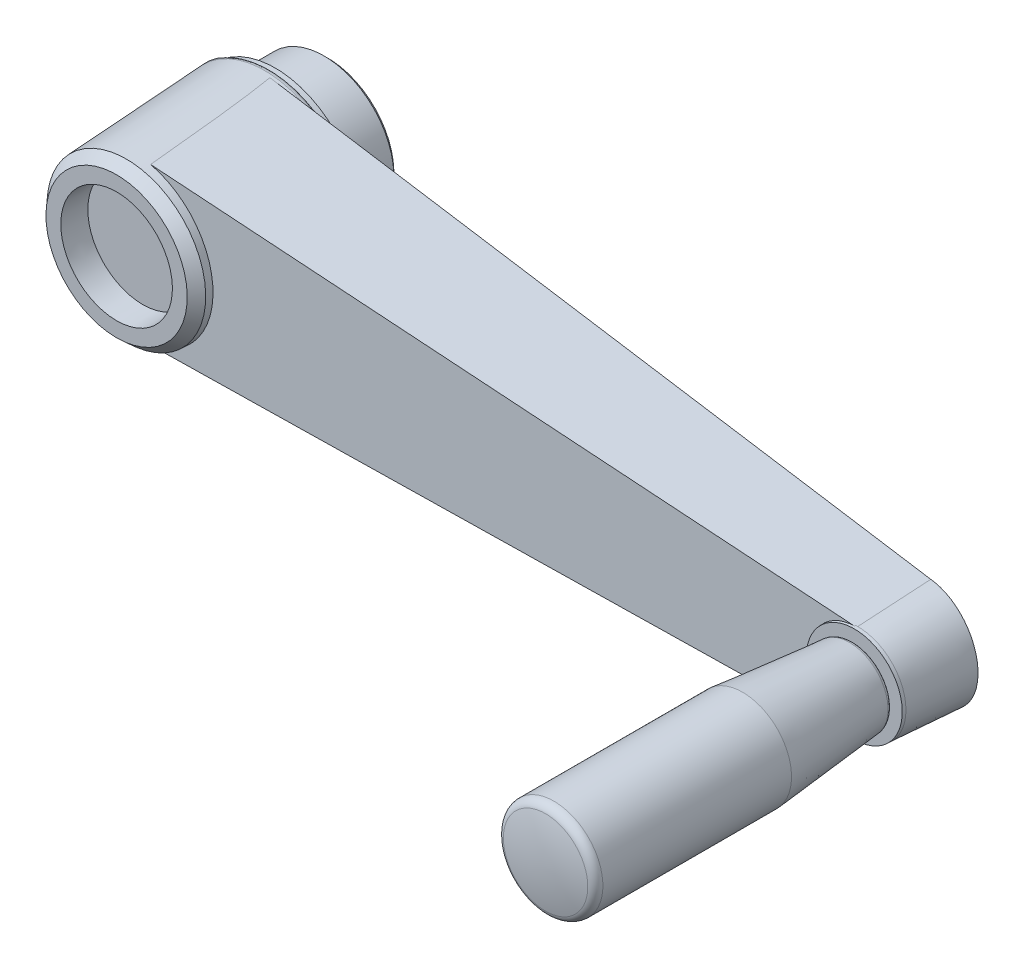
ISO-10303-21;
HEADER;
FILE_DESCRIPTION(('STEP AP214'),'2;1');
FILE_NAME('part.step','',(''),(''),'','','');
FILE_SCHEMA(('AUTOMOTIVE_DESIGN { 1 0 10303 214 1 1 1 1 }'));
ENDSEC;
DATA;
#1=APPLICATION_CONTEXT('core data for automotive mechanical design processes');
#2=APPLICATION_PROTOCOL_DEFINITION('international standard','automotive_design',2000,#1);
#3=PRODUCT_CONTEXT('',#1,'mechanical');
#4=PRODUCT('Part','Part','',(#3));
#5=PRODUCT_RELATED_PRODUCT_CATEGORY('part','',(#4));
#6=PRODUCT_DEFINITION_FORMATION('','',#4);
#7=PRODUCT_DEFINITION_CONTEXT('part definition',#1,'design');
#8=PRODUCT_DEFINITION('design','',#6,#7);
#9=PRODUCT_DEFINITION_SHAPE('','',#8);
#10=(LENGTH_UNIT() NAMED_UNIT(*) SI_UNIT(.MILLI.,.METRE.));
#11=(NAMED_UNIT(*) PLANE_ANGLE_UNIT() SI_UNIT($,.RADIAN.));
#12=(NAMED_UNIT(*) SI_UNIT($,.STERADIAN.) SOLID_ANGLE_UNIT());
#13=UNCERTAINTY_MEASURE_WITH_UNIT(LENGTH_MEASURE(1.E-05),#10,'distance_accuracy_value','');
#14=(GEOMETRIC_REPRESENTATION_CONTEXT(3) GLOBAL_UNCERTAINTY_ASSIGNED_CONTEXT((#13)) GLOBAL_UNIT_ASSIGNED_CONTEXT((#10,
#11,#12)) REPRESENTATION_CONTEXT('',''));
#15=CARTESIAN_POINT('',(0.,0.,0.));
#16=DIRECTION('',(0.,0.,1.));
#17=DIRECTION('',(1.,0.,0.));
#18=AXIS2_PLACEMENT_3D('',#15,#16,#17);
#19=CARTESIAN_POINT('',(-20.25,0.,60.5));
#20=DIRECTION('',(0.,0.,-1.));
#21=DIRECTION('',(0.,1.,0.));
#22=AXIS2_PLACEMENT_3D('',#19,#20,#21);
#23=PLANE('',#22);
#24=CARTESIAN_POINT('',(0.,0.,60.5));
#25=DIRECTION('',(0.,0.,1.));
#26=DIRECTION('',(0.,-1.,0.));
#27=AXIS2_PLACEMENT_3D('',#24,#25,#26);
#28=CIRCLE('',#27,20.25);
#29=CARTESIAN_POINT('',(0.,-20.25,60.5));
#30=VERTEX_POINT('',#29);
#31=EDGE_CURVE('E130',#30,#30,#28,.T.);
#32=ORIENTED_EDGE('',*,*,#31,.T.);
#33=EDGE_LOOP('',(#32));
#34=FACE_BOUND('',#33,.T.);
#35=CARTESIAN_POINT('',(0.,0.,60.5));
#36=DIRECTION('',(0.,0.,1.));
#37=DIRECTION('',(0.,-1.,0.));
#38=AXIS2_PLACEMENT_3D('',#35,#36,#37);
#39=CIRCLE('',#38,16.);
#40=CARTESIAN_POINT('',(0.,-16.,60.5));
#41=VERTEX_POINT('',#40);
#42=EDGE_CURVE('E98',#41,#41,#39,.T.);
#43=ORIENTED_EDGE('',*,*,#42,.F.);
#44=EDGE_LOOP('',(#43));
#45=FACE_BOUND('',#44,.T.);
#46=ADVANCED_FACE('F14',(#34,#45),#23,.F.);
#47=CARTESIAN_POINT('',(-25.,-25.,16.30400452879));
#48=DIRECTION('',(-0.095556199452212,0.,0.995424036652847));
#49=DIRECTION('',(-0.995424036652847,0.,-0.095556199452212));
#50=AXIS2_PLACEMENT_3D('',#47,#48,#49);
#51=PLANE('',#50);
#52=DIRECTION('',(0.994371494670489,0.0459743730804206,0.0954551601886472));
#53=VECTOR('',#52,1.);
#54=CARTESIAN_POINT('',(-24.953874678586,-26.0068296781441,16.308432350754));
#55=LINE('',#54,#53);
#56=CARTESIAN_POINT('',(211.9725550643,-15.0526298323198,39.052296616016));
#57=VERTEX_POINT('',#56);
#58=CARTESIAN_POINT('',(2.37783386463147,-24.7431589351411,18.9321525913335));
#59=VERTEX_POINT('',#58);
#60=EDGE_CURVE('E272',#57,#59,#55,.F.);
#61=ORIENTED_EDGE('',*,*,#60,.T.);
#62=CARTESIAN_POINT('',(-0.129764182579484,0.,18.691434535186));
#63=DIRECTION('',(-0.095556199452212,0.,0.995424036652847));
#64=DIRECTION('',(-0.995424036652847,0.,-0.095556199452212));
#65=AXIS2_PLACEMENT_3D('',#62,#63,#64);
#66=ELLIPSE('',#65,24.9845642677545,24.8698972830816);
#67=CARTESIAN_POINT('',(2.37783386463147,24.7431589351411,18.9321525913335));
#68=VERTEX_POINT('',#67);
#69=EDGE_CURVE('E137',#59,#68,#66,.T.);
#70=ORIENTED_EDGE('',*,*,#69,.T.);
#71=DIRECTION('',(-0.994371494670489,0.0459743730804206,-0.0954551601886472));
#72=VECTOR('',#71,1.);
#73=CARTESIAN_POINT('',(-22.66809437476,25.9011475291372,16.527856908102));
#74=LINE('',#73,#72);
#75=CARTESIAN_POINT('',(211.9725550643,15.0526298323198,39.052296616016));
#76=VERTEX_POINT('',#75);
#77=EDGE_CURVE('E264',#68,#76,#74,.F.);
#78=ORIENTED_EDGE('',*,*,#77,.T.);
#79=CARTESIAN_POINT('',(211.911618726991,0.,39.0464470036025));
#80=DIRECTION('',(-0.095556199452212,0.,0.995424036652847));
#81=DIRECTION('',(-0.995424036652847,0.,-0.095556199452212));
#82=AXIS2_PLACEMENT_3D('',#79,#80,#81);
#83=ELLIPSE('',#82,15.122211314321,15.0527531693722);
#84=EDGE_CURVE('E267',#57,#76,#83,.T.);
#85=ORIENTED_EDGE('',*,*,#84,.F.);
#86=EDGE_LOOP('',(#61,#70,#78,#85));
#87=FACE_BOUND('',#86,.T.);
#88=ADVANCED_FACE('F173',(#87),#51,.F.);
#89=CARTESIAN_POINT('',(0.,-25.,16.30400452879));
#90=DIRECTION('',(0.0402504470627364,-0.997322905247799,0.061048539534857));
#91=DIRECTION('',(0.,-0.0610980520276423,-0.998131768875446));
#92=AXIS2_PLACEMENT_3D('',#89,#90,#91);
#93=PLANE('',#92);
#94=DIRECTION('',(-0.998827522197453,-0.041805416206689,-0.0244108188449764));
#95=VECTOR('',#94,1.);
#96=CARTESIAN_POINT('',(225.275856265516,-13.1930385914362,60.66049770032));
#97=LINE('',#96,#95);
#98=CARTESIAN_POINT('',(4.51256396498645,-22.4329735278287,55.265159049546));
#99=VERTEX_POINT('',#98);
#100=CARTESIAN_POINT('',(211.352834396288,-13.7757795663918,60.32022637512));
#101=VERTEX_POINT('',#100);
#102=EDGE_CURVE('E263',#99,#101,#97,.F.);
#103=ORIENTED_EDGE('',*,*,#102,.F.);
#104=CARTESIAN_POINT('',(0.477436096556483,-11.8298799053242,231.143630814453));
#105=DIRECTION('',(0.0402504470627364,-0.997322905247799,0.061048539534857));
#106=DIRECTION('',(0.00246182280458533,-0.0609988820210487,-0.998134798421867));
#107=AXIS2_PLACEMENT_3D('',#104,#105,#106);
#108=ELLIPSE('',#107,218.232965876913,6.10926333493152);
#109=EDGE_CURVE('E38',#99,#59,#108,.F.);
#110=ORIENTED_EDGE('',*,*,#109,.T.);
#111=ORIENTED_EDGE('',*,*,#60,.F.);
#112=CARTESIAN_POINT('',(211.947727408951,-13.7302029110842,60.6725678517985));
#113=CARTESIAN_POINT('',(211.957376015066,-14.2568999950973,52.0617897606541));
#114=CARTESIAN_POINT('',(211.967313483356,-14.7835854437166,43.4510112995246));
#115=CARTESIAN_POINT('',(211.984877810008,-15.6881788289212,28.661490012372));
#116=CARTESIAN_POINT('',(211.992364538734,-16.0660924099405,22.482747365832));
#117=CARTESIAN_POINT('',(212.,-16.444,16.30400452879));
#118=B_SPLINE_CURVE_WITH_KNOTS('',3,(#112,#113,#114,#115,#116,#117),.UNSPECIFIED.,.F.,.F.,(4,2,
4),(0.,25.8806301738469,44.4515111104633),.UNSPECIFIED.);
#119=CARTESIAN_POINT('',(211.948479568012,-13.7713420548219,60.));
#120=VERTEX_POINT('',#119);
#121=EDGE_CURVE('E226',#120,#57,#118,.T.);
#122=ORIENTED_EDGE('',*,*,#121,.F.);
#123=DIRECTION('',(-0.999186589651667,-0.040325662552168,0.));
#124=VECTOR('',#123,1.);
#125=CARTESIAN_POINT('',(-0.107772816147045,-22.3296123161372,60.));
#126=LINE('',#125,#124);
#127=CARTESIAN_POINT('',(211.356038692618,-13.7952520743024,60.));
#128=VERTEX_POINT('',#127);
#129=EDGE_CURVE('E527',#128,#120,#126,.F.);
#130=ORIENTED_EDGE('',*,*,#129,.F.);
#131=CARTESIAN_POINT('',(212.347293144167,-8.60520647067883,144.133919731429));
#132=DIRECTION('',(0.0402504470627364,-0.997322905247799,0.061048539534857));
#133=DIRECTION('',(0.00246182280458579,-0.0609988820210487,-0.998134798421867));
#134=AXIS2_PLACEMENT_3D('',#131,#132,#133);
#135=ELLIPSE('',#134,143.15153477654,1.48434772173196);
#136=EDGE_CURVE('E526',#128,#101,#135,.F.);
#137=ORIENTED_EDGE('',*,*,#136,.T.);
#138=EDGE_LOOP('',(#103,#110,#111,#122,#130,#137));
#139=FACE_BOUND('',#138,.T.);
#140=ADVANCED_FACE('F217',(#139),#93,.T.);
#141=CARTESIAN_POINT('',(212.,0.,16.30400452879));
#142=DIRECTION('',(0.,0.,-1.));
#143=DIRECTION('',(0.,1.,0.));
#144=AXIS2_PLACEMENT_3D('',#141,#142,#143);
#145=CONICAL_SURFACE('',#144,16.444,0.0610865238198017);
#146=CARTESIAN_POINT('',(211.947727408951,13.7302029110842,60.6725678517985));
#147=CARTESIAN_POINT('',(211.957376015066,14.2568999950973,52.0617897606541));
#148=CARTESIAN_POINT('',(211.967313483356,14.7835854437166,43.4510112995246));
#149=CARTESIAN_POINT('',(211.984877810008,15.6881788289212,28.661490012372));
#150=CARTESIAN_POINT('',(211.992364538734,16.0660924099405,22.482747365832));
#151=CARTESIAN_POINT('',(212.,16.444,16.30400452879));
#152=B_SPLINE_CURVE_WITH_KNOTS('',3,(#146,#147,#148,#149,#150,#151),.UNSPECIFIED.,.F.,.F.,(4,2,
4),(0.,25.8806301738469,44.4515111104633),.UNSPECIFIED.);
#153=CARTESIAN_POINT('',(211.948479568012,13.7713420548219,60.));
#154=VERTEX_POINT('',#153);
#155=EDGE_CURVE('E235',#154,#76,#152,.T.);
#156=ORIENTED_EDGE('',*,*,#155,.F.);
#157=CARTESIAN_POINT('',(212.,0.,60.));
#158=DIRECTION('',(0.,0.,1.));
#159=DIRECTION('',(-1.,0.,0.));
#160=AXIS2_PLACEMENT_3D('',#157,#158,#159);
#161=CIRCLE('',#160,13.7714384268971);
#162=EDGE_CURVE('E541',#154,#120,#161,.F.);
#163=ORIENTED_EDGE('',*,*,#162,.T.);
#164=ORIENTED_EDGE('',*,*,#121,.T.);
#165=ORIENTED_EDGE('',*,*,#84,.T.);
#166=EDGE_LOOP('',(#156,#163,#164,#165));
#167=FACE_BOUND('',#166,.T.);
#168=ADVANCED_FACE('F221',(#167),#145,.T.);
#169=CARTESIAN_POINT('',(212.,16.444,16.30400452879));
#170=DIRECTION('',(0.0402504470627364,0.997322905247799,0.061048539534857));
#171=DIRECTION('',(0.,-0.0610980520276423,0.998131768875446));
#172=AXIS2_PLACEMENT_3D('',#169,#170,#171);
#173=PLANE('',#172);
#174=ORIENTED_EDGE('',*,*,#77,.F.);
#175=CARTESIAN_POINT('',(0.477436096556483,11.8298799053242,231.143630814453));
#176=DIRECTION('',(0.0402504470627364,0.997322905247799,0.061048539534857));
#177=DIRECTION('',(0.00246182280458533,0.0609988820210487,-0.998134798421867));
#178=AXIS2_PLACEMENT_3D('',#175,#176,#177);
#179=ELLIPSE('',#178,218.232965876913,6.10926333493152);
#180=CARTESIAN_POINT('',(4.51256396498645,22.4329735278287,55.265159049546));
#181=VERTEX_POINT('',#180);
#182=EDGE_CURVE('E133',#68,#181,#179,.F.);
#183=ORIENTED_EDGE('',*,*,#182,.T.);
#184=DIRECTION('',(0.998827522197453,-0.041805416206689,0.0244108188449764));
#185=VECTOR('',#184,1.);
#186=CARTESIAN_POINT('',(227.363676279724,13.1056539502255,60.711522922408));
#187=LINE('',#186,#185);
#188=CARTESIAN_POINT('',(211.352834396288,13.7757795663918,60.32022637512));
#189=VERTEX_POINT('',#188);
#190=EDGE_CURVE('E234',#189,#181,#187,.F.);
#191=ORIENTED_EDGE('',*,*,#190,.F.);
#192=CARTESIAN_POINT('',(212.347293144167,8.60520647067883,144.133919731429));
#193=DIRECTION('',(0.0402504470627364,0.997322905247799,0.061048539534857));
#194=DIRECTION('',(0.00246182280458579,0.0609988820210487,-0.998134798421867));
#195=AXIS2_PLACEMENT_3D('',#192,#193,#194);
#196=ELLIPSE('',#195,143.15153477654,1.48434772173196);
#197=CARTESIAN_POINT('',(211.356038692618,13.7952520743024,60.));
#198=VERTEX_POINT('',#197);
#199=EDGE_CURVE('E531',#189,#198,#196,.F.);
#200=ORIENTED_EDGE('',*,*,#199,.T.);
#201=DIRECTION('',(0.999186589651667,-0.0403256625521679,0.));
#202=VECTOR('',#201,1.);
#203=CARTESIAN_POINT('',(211.892227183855,13.7736123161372,60.));
#204=LINE('',#203,#202);
#205=EDGE_CURVE('E534',#154,#198,#204,.F.);
#206=ORIENTED_EDGE('',*,*,#205,.F.);
#207=ORIENTED_EDGE('',*,*,#155,.T.);
#208=EDGE_LOOP('',(#174,#183,#191,#200,#206,#207));
#209=FACE_BOUND('',#208,.T.);
#210=ADVANCED_FACE('F244',(#209),#173,.T.);
#211=CARTESIAN_POINT('',(225.769735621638,-25.,60.6725678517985));
#212=DIRECTION('',(0.0244321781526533,0.,-0.999701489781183));
#213=DIRECTION('',(0.999701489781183,0.,0.0244321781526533));
#214=AXIS2_PLACEMENT_3D('',#211,#212,#213);
#215=PLANE('',#214);
#216=ORIENTED_EDGE('',*,*,#190,.T.);
#217=CARTESIAN_POINT('',(-0.0304040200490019,0.,55.154131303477));
#218=DIRECTION('',(0.0244321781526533,0.,-0.999701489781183));
#219=DIRECTION('',(-0.999701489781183,0.,-0.0244321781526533));
#220=AXIS2_PLACEMENT_3D('',#217,#218,#219);
#221=ELLIPSE('',#220,22.8952102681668,22.8883556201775);
#222=EDGE_CURVE('E258',#181,#99,#221,.T.);
#223=ORIENTED_EDGE('',*,*,#222,.T.);
#224=ORIENTED_EDGE('',*,*,#102,.T.);
#225=CARTESIAN_POINT('',(211.979686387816,0.,60.335546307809));
#226=DIRECTION('',(0.0244321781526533,0.,-0.999701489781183));
#227=DIRECTION('',(-0.999701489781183,0.,-0.0244321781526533));
#228=AXIS2_PLACEMENT_3D('',#225,#226,#227);
#229=ELLIPSE('',#228,13.7941669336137,13.7900342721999);
#230=CARTESIAN_POINT('',(198.250000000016,-1.28886227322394,60.));
#231=VERTEX_POINT('',#230);
#232=EDGE_CURVE('E278',#101,#231,#229,.T.);
#233=ORIENTED_EDGE('',*,*,#232,.T.);
#234=DIRECTION('',(0.,-1.,0.));
#235=VECTOR('',#234,1.);
#236=CARTESIAN_POINT('',(198.25,-25.,60.));
#237=LINE('',#236,#235);
#238=CARTESIAN_POINT('',(198.250000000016,1.28886227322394,60.));
#239=VERTEX_POINT('',#238);
#240=EDGE_CURVE('E280',#239,#231,#237,.T.);
#241=ORIENTED_EDGE('',*,*,#240,.F.);
#242=EDGE_CURVE('E261',#239,#189,#229,.T.);
#243=ORIENTED_EDGE('',*,*,#242,.T.);
#244=EDGE_LOOP('',(#216,#223,#224,#233,#241,#243));
#245=FACE_BOUND('',#244,.T.);
#246=ADVANCED_FACE('F212',(#245),#215,.F.);
#247=CARTESIAN_POINT('',(212.,0.,60.));
#248=DIRECTION('',(0.,0.,1.));
#249=DIRECTION('',(-1.,0.,0.));
#250=AXIS2_PLACEMENT_3D('',#247,#248,#249);
#251=PLANE('',#250);
#252=CARTESIAN_POINT('',(212.,0.,60.));
#253=DIRECTION('',(0.,0.,1.));
#254=DIRECTION('',(-1.,0.,0.));
#255=AXIS2_PLACEMENT_3D('',#252,#253,#254);
#256=CIRCLE('',#255,13.8102739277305);
#257=EDGE_CURVE('E532',#128,#198,#256,.T.);
#258=ORIENTED_EDGE('',*,*,#257,.F.);
#259=ORIENTED_EDGE('',*,*,#129,.T.);
#260=ORIENTED_EDGE('',*,*,#162,.F.);
#261=ORIENTED_EDGE('',*,*,#205,.T.);
#262=EDGE_LOOP('',(#258,#259,#260,#261));
#263=FACE_BOUND('',#262,.T.);
#264=ADVANCED_FACE('F209',(#263),#251,.F.);
#265=EDGE_CURVE('E536',#239,#231,#256,.T.);
#266=ORIENTED_EDGE('',*,*,#265,.F.);
#267=ORIENTED_EDGE('',*,*,#240,.T.);
#268=EDGE_LOOP('',(#266,#267));
#269=FACE_BOUND('',#268,.T.);
#270=ADVANCED_FACE('F207',(#269),#251,.F.);
#271=CARTESIAN_POINT('',(212.,0.,61.));
#272=DIRECTION('',(0.,0.,-1.));
#273=DIRECTION('',(1.,0.,0.));
#274=AXIS2_PLACEMENT_3D('',#271,#272,#273);
#275=CONICAL_SURFACE('',#274,13.7500000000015,0.0602010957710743);
#276=CARTESIAN_POINT('',(212.,0.,61.));
#277=DIRECTION('',(0.,0.,1.));
#278=DIRECTION('',(-1.,0.,0.));
#279=AXIS2_PLACEMENT_3D('',#276,#277,#278);
#280=CIRCLE('',#279,13.7500000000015);
#281=CARTESIAN_POINT('',(198.249999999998,0.,61.));
#282=VERTEX_POINT('',#281);
#283=EDGE_CURVE('E547',#282,#282,#280,.T.);
#284=ORIENTED_EDGE('',*,*,#283,.F.);
#285=EDGE_LOOP('',(#284));
#286=FACE_BOUND('',#285,.T.);
#287=ORIENTED_EDGE('',*,*,#199,.F.);
#288=ORIENTED_EDGE('',*,*,#242,.F.);
#289=ORIENTED_EDGE('',*,*,#265,.T.);
#290=ORIENTED_EDGE('',*,*,#232,.F.);
#291=ORIENTED_EDGE('',*,*,#136,.F.);
#292=ORIENTED_EDGE('',*,*,#257,.T.);
#293=EDGE_LOOP('',(#287,#288,#289,#290,#291,#292));
#294=FACE_BOUND('',#293,.T.);
#295=ADVANCED_FACE('F204',(#286,#294),#275,.T.);
#296=CARTESIAN_POINT('',(212.,0.,101.));
#297=DIRECTION('',(0.,-1.,0.));
#298=DIRECTION('',(1.,0.,0.));
#299=AXIS2_PLACEMENT_3D('',#296,#297,#298);
#300=SPHERICAL_SURFACE('',#299,50.);
#301=CARTESIAN_POINT('',(212.,0.,101.));
#302=DIRECTION('',(0.,0.,1.));
#303=DIRECTION('',(-1.,0.,0.));
#304=AXIS2_PLACEMENT_3D('',#301,#302,#303);
#305=SPHERICAL_SURFACE('',#304,50.);
#306=CARTESIAN_POINT('',(212.,0.,149.512499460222));
#307=DIRECTION('',(0.,0.,1.));
#308=DIRECTION('',(-1.,0.,0.));
#309=AXIS2_PLACEMENT_3D('',#306,#307,#308);
#310=CIRCLE('',#309,12.1052631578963);
#311=CARTESIAN_POINT('',(199.894736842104,0.,149.512499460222));
#312=VERTEX_POINT('',#311);
#313=EDGE_CURVE('E569',#312,#312,#310,.T.);
#314=ORIENTED_EDGE('',*,*,#313,.T.);
#315=EDGE_LOOP('',(#314));
#316=FACE_BOUND('',#315,.T.);
#317=ADVANCED_FACE('F202',(#316),#305,.T.);
#318=CARTESIAN_POINT('',(225.75,0.,61.));
#319=DIRECTION('',(0.,0.,-1.));
#320=DIRECTION('',(1.,0.,0.));
#321=AXIS2_PLACEMENT_3D('',#318,#319,#320);
#322=PLANE('',#321);
#323=CARTESIAN_POINT('',(212.,0.,61.));
#324=DIRECTION('',(0.,0.,1.));
#325=DIRECTION('',(-1.,0.,0.));
#326=AXIS2_PLACEMENT_3D('',#323,#324,#325);
#327=CIRCLE('',#326,6.00000000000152);
#328=CARTESIAN_POINT('',(205.999999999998,0.,61.));
#329=VERTEX_POINT('',#328);
#330=EDGE_CURVE('E549',#329,#329,#327,.T.);
#331=ORIENTED_EDGE('',*,*,#330,.F.);
#332=EDGE_LOOP('',(#331));
#333=FACE_BOUND('',#332,.T.);
#334=ORIENTED_EDGE('',*,*,#283,.T.);
#335=EDGE_LOOP('',(#334));
#336=FACE_BOUND('',#335,.T.);
#337=ADVANCED_FACE('F198',(#333,#336),#322,.F.);
#338=CARTESIAN_POINT('',(212.,0.,158.949374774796));
#339=DIRECTION('',(0.,0.,1.));
#340=DIRECTION('',(-1.,0.,0.));
#341=AXIS2_PLACEMENT_3D('',#338,#339,#340);
#342=CYLINDRICAL_SURFACE('',#341,6.0000000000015);
#343=ORIENTED_EDGE('',*,*,#330,.T.);
#344=EDGE_LOOP('',(#343));
#345=FACE_BOUND('',#344,.T.);
#346=CARTESIAN_POINT('',(212.,0.,61.3));
#347=DIRECTION('',(0.,0.,1.));
#348=DIRECTION('',(-1.,0.,0.));
#349=AXIS2_PLACEMENT_3D('',#346,#347,#348);
#350=CIRCLE('',#349,6.00000000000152);
#351=CARTESIAN_POINT('',(205.999999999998,0.,61.3));
#352=VERTEX_POINT('',#351);
#353=EDGE_CURVE('E553',#352,#352,#350,.T.);
#354=ORIENTED_EDGE('',*,*,#353,.F.);
#355=EDGE_LOOP('',(#354));
#356=FACE_BOUND('',#355,.T.);
#357=ADVANCED_FACE('F194',(#345,#356),#342,.T.);
#358=CARTESIAN_POINT('',(218.,0.,61.3));
#359=DIRECTION('',(0.,0.,1.));
#360=DIRECTION('',(-1.,0.,0.));
#361=AXIS2_PLACEMENT_3D('',#358,#359,#360);
#362=PLANE('',#361);
#363=CARTESIAN_POINT('',(212.,0.,61.3));
#364=DIRECTION('',(0.,0.,1.));
#365=DIRECTION('',(-1.,0.,0.));
#366=AXIS2_PLACEMENT_3D('',#363,#364,#365);
#367=CIRCLE('',#366,9.86271137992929);
#368=CARTESIAN_POINT('',(202.137288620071,0.,61.3));
#369=VERTEX_POINT('',#368);
#370=EDGE_CURVE('E558',#369,#369,#367,.T.);
#371=ORIENTED_EDGE('',*,*,#370,.F.);
#372=EDGE_LOOP('',(#371));
#373=FACE_BOUND('',#372,.T.);
#374=ORIENTED_EDGE('',*,*,#353,.T.);
#375=EDGE_LOOP('',(#374));
#376=FACE_BOUND('',#375,.T.);
#377=ADVANCED_FACE('F190',(#373,#376),#362,.F.);
#378=CARTESIAN_POINT('',(212.,0.,62.55));
#379=DIRECTION('',(0.,0.,1.));
#380=DIRECTION('',(-1.,0.,0.));
#381=AXIS2_PLACEMENT_3D('',#378,#379,#380);
#382=TOROIDAL_SURFACE('',#381,9.86271137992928,1.25);
#383=ORIENTED_EDGE('',*,*,#370,.T.);
#384=EDGE_LOOP('',(#383));
#385=FACE_BOUND('',#384,.T.);
#386=CARTESIAN_POINT('',(212.,0.,62.432229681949));
#387=DIRECTION('',(0.,0.,1.));
#388=DIRECTION('',(-1.,0.,0.));
#389=AXIS2_PLACEMENT_3D('',#386,#387,#388);
#390=CIRCLE('',#389,11.107151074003);
#391=CARTESIAN_POINT('',(200.892848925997,0.,62.432229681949));
#392=VERTEX_POINT('',#391);
#393=EDGE_CURVE('E561',#392,#392,#390,.T.);
#394=ORIENTED_EDGE('',*,*,#393,.F.);
#395=EDGE_LOOP('',(#394));
#396=FACE_BOUND('',#395,.T.);
#397=ADVANCED_FACE('F186',(#385,#396),#382,.T.);
#398=CARTESIAN_POINT('',(212.,0.,93.));
#399=DIRECTION('',(0.,0.,1.));
#400=DIRECTION('',(-1.,0.,0.));
#401=AXIS2_PLACEMENT_3D('',#398,#399,#400);
#402=CONICAL_SURFACE('',#401,14.0000000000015,0.0943562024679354);
#403=ORIENTED_EDGE('',*,*,#393,.T.);
#404=EDGE_LOOP('',(#403));
#405=FACE_BOUND('',#404,.T.);
#406=CARTESIAN_POINT('',(212.,0.,93.));
#407=DIRECTION('',(0.,0.,1.));
#408=DIRECTION('',(-1.,0.,0.));
#409=AXIS2_PLACEMENT_3D('',#406,#407,#408);
#410=CIRCLE('',#409,14.0000000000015);
#411=CARTESIAN_POINT('',(197.999999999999,0.,93.));
#412=VERTEX_POINT('',#411);
#413=EDGE_CURVE('E564',#412,#412,#410,.T.);
#414=ORIENTED_EDGE('',*,*,#413,.F.);
#415=EDGE_LOOP('',(#414));
#416=FACE_BOUND('',#415,.T.);
#417=ADVANCED_FACE('F182',(#405,#416),#402,.T.);
#418=CARTESIAN_POINT('',(212.,0.,158.949374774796));
#419=DIRECTION('',(0.,0.,1.));
#420=DIRECTION('',(-1.,0.,0.));
#421=AXIS2_PLACEMENT_3D('',#418,#419,#420);
#422=CYLINDRICAL_SURFACE('',#421,14.0000000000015);
#423=CARTESIAN_POINT('',(212.,0.,147.086874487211));
#424=DIRECTION('',(0.,0.,1.));
#425=DIRECTION('',(-1.,0.,0.));
#426=AXIS2_PLACEMENT_3D('',#423,#424,#425);
#427=CIRCLE('',#426,14.0000000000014);
#428=CARTESIAN_POINT('',(197.999999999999,0.,147.086874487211));
#429=VERTEX_POINT('',#428);
#430=EDGE_CURVE('E567',#429,#429,#427,.T.);
#431=ORIENTED_EDGE('',*,*,#430,.F.);
#432=EDGE_LOOP('',(#431));
#433=FACE_BOUND('',#432,.T.);
#434=ORIENTED_EDGE('',*,*,#413,.T.);
#435=EDGE_LOOP('',(#434));
#436=FACE_BOUND('',#435,.T.);
#437=ADVANCED_FACE('F178',(#433,#436),#422,.T.);
#438=CARTESIAN_POINT('',(212.,0.,147.086874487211));
#439=DIRECTION('',(0.,0.,1.));
#440=DIRECTION('',(-1.,0.,0.));
#441=AXIS2_PLACEMENT_3D('',#438,#439,#440);
#442=TOROIDAL_SURFACE('',#441,11.5000000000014,2.50000000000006);
#443=ORIENTED_EDGE('',*,*,#430,.T.);
#444=EDGE_LOOP('',(#443));
#445=FACE_BOUND('',#444,.T.);
#446=ORIENTED_EDGE('',*,*,#313,.F.);
#447=EDGE_LOOP('',(#446));
#448=FACE_BOUND('',#447,.T.);
#449=ADVANCED_FACE('F175',(#445,#448),#442,.T.);
#450=CARTESIAN_POINT('',(0.,0.,65.));
#451=DIRECTION('',(0.,0.,1.));
#452=DIRECTION('',(0.,-1.,0.));
#453=AXIS2_PLACEMENT_3D('',#450,#451,#452);
#454=CYLINDRICAL_SURFACE('',#453,24.);
#455=CARTESIAN_POINT('',(0.,0.,15.));
#456=DIRECTION('',(0.,0.,1.));
#457=DIRECTION('',(0.,-1.,0.));
#458=AXIS2_PLACEMENT_3D('',#455,#456,#457);
#459=CIRCLE('',#458,24.);
#460=CARTESIAN_POINT('',(0.,-24.,15.));
#461=VERTEX_POINT('',#460);
#462=EDGE_CURVE('E119',#461,#461,#459,.T.);
#463=ORIENTED_EDGE('',*,*,#462,.T.);
#464=EDGE_LOOP('',(#463));
#465=FACE_BOUND('',#464,.T.);
#466=CARTESIAN_POINT('',(0.,0.,16.5857128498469));
#467=DIRECTION('',(0.,0.,1.));
#468=DIRECTION('',(0.,-1.,0.));
#469=AXIS2_PLACEMENT_3D('',#466,#467,#468);
#470=CIRCLE('',#469,24.);
#471=CARTESIAN_POINT('',(-22.065399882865,-9.44023982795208,16.5857128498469));
#472=VERTEX_POINT('',#471);
#473=CARTESIAN_POINT('',(-22.065399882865,9.44023982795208,16.5857128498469));
#474=VERTEX_POINT('',#473);
#475=EDGE_CURVE('E122',#472,#474,#470,.T.);
#476=ORIENTED_EDGE('',*,*,#475,.F.);
#477=CARTESIAN_POINT('',(0.,0.,18.703891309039));
#478=DIRECTION('',(-0.095556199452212,0.,0.995424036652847));
#479=DIRECTION('',(0.995424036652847,0.,0.095556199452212));
#480=AXIS2_PLACEMENT_3D('',#477,#478,#479);
#481=ELLIPSE('',#480,24.1103279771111,24.);
#482=EDGE_CURVE('E9',#472,#474,#481,.F.);
#483=ORIENTED_EDGE('',*,*,#482,.T.);
#484=EDGE_LOOP('',(#476,#483));
#485=FACE_BOUND('',#484,.T.);
#486=ADVANCED_FACE('F159',(#465,#485),#454,.T.);
#487=CARTESIAN_POINT('',(0.,0.,17.963765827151));
#488=DIRECTION('',(0.,0.,1.));
#489=DIRECTION('',(0.,-1.,0.));
#490=AXIS2_PLACEMENT_3D('',#487,#488,#489);
#491=TOROIDAL_SURFACE('',#490,23.4075727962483,1.50000000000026);
#492=CARTESIAN_POINT('',(0.,0.,18.0451752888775));
#493=DIRECTION('',(0.,0.,1.));
#494=DIRECTION('',(0.,-1.,0.));
#495=AXIS2_PLACEMENT_3D('',#492,#493,#494);
#496=CIRCLE('',#495,24.9053620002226);
#497=CARTESIAN_POINT('',(0.,-24.9053620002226,18.0451752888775));
#498=VERTEX_POINT('',#497);
#499=EDGE_CURVE('E124',#498,#498,#496,.T.);
#500=ORIENTED_EDGE('',*,*,#499,.F.);
#501=EDGE_LOOP('',(#500));
#502=FACE_BOUND('',#501,.T.);
#503=CARTESIAN_POINT('',(-6.85986549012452,23.9419873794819,18.0453752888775));
#504=CARTESIAN_POINT('',(-7.34033994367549,23.8069453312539,17.9992519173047));
#505=CARTESIAN_POINT('',(-7.81612176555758,23.6553745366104,17.95357901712));
#506=CARTESIAN_POINT('',(-8.75707913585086,23.3198762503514,17.86325137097));
#507=CARTESIAN_POINT('',(-9.22223706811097,23.1358988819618,17.8185983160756));
#508=CARTESIAN_POINT('',(-10.2574338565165,22.6852527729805,17.7192241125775));
#509=CARTESIAN_POINT('',(-10.8235923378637,22.4094938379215,17.6648754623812));
#510=CARTESIAN_POINT('',(-11.6538558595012,21.9606445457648,17.5851739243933));
#511=CARTESIAN_POINT('',(-11.9275205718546,21.8051120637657,17.5589033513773));
#512=CARTESIAN_POINT('',(-12.468155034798,21.4825644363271,17.5070048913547));
#513=CARTESIAN_POINT('',(-12.7351231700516,21.3155465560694,17.481377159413));
#514=CARTESIAN_POINT('',(-13.5257876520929,20.7974022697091,17.4054769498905));
#515=CARTESIAN_POINT('',(-14.0386991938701,20.4294800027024,17.3562397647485));
#516=CARTESIAN_POINT('',(-15.0320674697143,19.6517939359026,17.260880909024));
#517=CARTESIAN_POINT('',(-15.5125236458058,19.2420294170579,17.2147592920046));
#518=CARTESIAN_POINT('',(-16.2066520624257,18.5981320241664,17.1481261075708));
#519=CARTESIAN_POINT('',(-16.4337548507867,18.3784571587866,17.1263252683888));
#520=CARTESIAN_POINT('',(-16.8785953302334,17.9298526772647,17.083622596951));
#521=CARTESIAN_POINT('',(-17.0963354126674,17.7009254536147,17.0627205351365));
#522=CARTESIAN_POINT('',(-17.7351350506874,17.0006922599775,17.001398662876));
#523=CARTESIAN_POINT('',(-18.1417617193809,16.5159461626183,16.9623643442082));
#524=CARTESIAN_POINT('',(-18.9131719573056,15.514884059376,16.8883124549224));
#525=CARTESIAN_POINT('',(-19.2780000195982,14.9986025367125,16.8532906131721));
#526=CARTESIAN_POINT('',(-19.9639128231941,13.9377337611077,16.7874460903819));
#527=CARTESIAN_POINT('',(-20.2850127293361,13.3931564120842,16.7566219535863));
#528=CARTESIAN_POINT('',(-20.8758166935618,12.289989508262,16.6999074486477));
#529=CARTESIAN_POINT('',(-21.1463866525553,11.7318674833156,16.6739339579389));
#530=CARTESIAN_POINT('',(-21.6415660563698,10.5965840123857,16.6263989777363));
#531=CARTESIAN_POINT('',(-21.8662555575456,10.0194578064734,16.604829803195));
#532=CARTESIAN_POINT('',(-22.0674833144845,9.43418461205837,16.5855128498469));
#533=B_SPLINE_CURVE_WITH_KNOTS('',3,(#503,#504,#505,#506,#507,#508,#509,#510,#511,#512,#513,
#514,#515,#516,#517,#518,#519,#520,#521,#522,#523,#524,#525,#526,#527,#528,#529,#530,#531,#532),
.UNSPECIFIED.,.F.,.F.,(4,2,2,2,2,2,2,2,2,2,2,2,2,2,4),(0.,1.50319870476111,3.008731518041,
4.90243408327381,5.84980603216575,6.79740434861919,8.69446007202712,10.5915484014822,
11.5414498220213,12.4911071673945,14.3904720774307,16.2877960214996,18.1844602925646,
20.0448313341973,21.9019279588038),.UNSPECIFIED.);
#534=CARTESIAN_POINT('',(-8.72177079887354,23.3272609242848,17.866640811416));
#535=VERTEX_POINT('',#534);
#536=EDGE_CURVE('E30',#535,#474,#533,.T.);
#537=ORIENTED_EDGE('',*,*,#536,.F.);
#538=CARTESIAN_POINT('',(0.,0.,17.866640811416));
#539=DIRECTION('',(0.,0.,1.));
#540=DIRECTION('',(0.,-1.,0.));
#541=AXIS2_PLACEMENT_3D('',#538,#539,#540);
#542=CIRCLE('',#541,24.9044250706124);
#543=CARTESIAN_POINT('',(-8.72177079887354,-23.3272609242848,17.866640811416));
#544=VERTEX_POINT('',#543);
#545=EDGE_CURVE('E23',#544,#535,#542,.F.);
#546=ORIENTED_EDGE('',*,*,#545,.F.);
#547=CARTESIAN_POINT('',(-22.0674833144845,-9.43418461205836,16.5855128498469));
#548=CARTESIAN_POINT('',(-21.9046478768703,-9.90771265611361,16.6011443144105));
#549=CARTESIAN_POINT('',(-21.726497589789,-10.3758849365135,16.6182459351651));
#550=CARTESIAN_POINT('',(-21.3399689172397,-11.3004529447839,16.6553509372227));
#551=CARTESIAN_POINT('',(-21.131536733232,-11.7568259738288,16.6753594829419));
#552=CARTESIAN_POINT('',(-20.6218982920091,-12.7829434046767,16.7242824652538));
#553=CARTESIAN_POINT('',(-20.3111777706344,-13.3479498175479,16.7541102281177));
#554=CARTESIAN_POINT('',(-19.6434571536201,-14.4499530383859,16.8182083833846));
#555=CARTESIAN_POINT('',(-19.2864370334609,-14.9869375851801,16.8524806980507));
#556=CARTESIAN_POINT('',(-18.5280864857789,-16.029474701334,16.9252789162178));
#557=CARTESIAN_POINT('',(-18.1266969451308,-16.5349839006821,16.963810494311));
#558=CARTESIAN_POINT('',(-17.2827954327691,-17.5099684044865,17.044821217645));
#559=CARTESIAN_POINT('',(-16.8402890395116,-17.9794485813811,17.0872998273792));
#560=CARTESIAN_POINT('',(-15.917534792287,-18.8785549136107,17.1758800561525));
#561=CARTESIAN_POINT('',(-15.4373186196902,-19.3082138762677,17.2219786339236));
#562=CARTESIAN_POINT('',(-14.4420883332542,-20.1248850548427,17.3175162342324));
#563=CARTESIAN_POINT('',(-13.9270695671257,-20.5118915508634,17.3669557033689));
#564=CARTESIAN_POINT('',(-12.8666565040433,-21.239633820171,17.4687505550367));
#565=CARTESIAN_POINT('',(-12.3213058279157,-21.5804337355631,17.5211017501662));
#566=CARTESIAN_POINT('',(-11.203650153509,-22.213504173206,17.6283916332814));
#567=CARTESIAN_POINT('',(-10.6313568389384,-22.505795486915,17.6833291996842));
#568=CARTESIAN_POINT('',(-9.53182877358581,-23.0083739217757,17.7888789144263));
#569=CARTESIAN_POINT('',(-9.00711712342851,-23.2242482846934,17.8392488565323));
#570=CARTESIAN_POINT('',(-7.94354167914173,-23.6144663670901,17.9413472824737));
#571=CARTESIAN_POINT('',(-7.40470122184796,-23.7888743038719,17.9930735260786));
#572=CARTESIAN_POINT('',(-6.85986549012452,-23.9419873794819,18.0453752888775));
#573=B_SPLINE_CURVE_WITH_KNOTS('',3,(#547,#548,#549,#550,#551,#552,#553,#554,#555,#556,#557,
#558,#559,#560,#561,#562,#563,#564,#565,#566,#567,#568,#569,#570,#571,#572),.UNSPECIFIED.,.F.,
.F.,(4,2,2,2,2,2,2,2,2,2,2,2,4),(0.,1.50262164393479,3.00794623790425,4.9420824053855,
6.87705789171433,8.81464313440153,10.7519658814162,12.6876780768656,14.6236495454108,
16.5569054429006,18.4893305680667,20.1965162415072,21.9010405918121),.UNSPECIFIED.);
#574=EDGE_CURVE('E140',#472,#544,#573,.T.);
#575=ORIENTED_EDGE('',*,*,#574,.F.);
#576=ORIENTED_EDGE('',*,*,#475,.T.);
#577=EDGE_LOOP('',(#537,#546,#575,#576));
#578=FACE_BOUND('',#577,.T.);
#579=ADVANCED_FACE('F153',(#502,#578),#491,.T.);
#580=CARTESIAN_POINT('',(0.,0.,57.7));
#581=DIRECTION('',(0.,0.,-1.));
#582=DIRECTION('',(0.,1.,0.));
#583=AXIS2_PLACEMENT_3D('',#580,#581,#582);
#584=CONICAL_SURFACE('',#583,22.75,0.0542996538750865);
#585=CARTESIAN_POINT('',(0.,0.,57.7));
#586=DIRECTION('',(0.,0.,1.));
#587=DIRECTION('',(0.,-1.,0.));
#588=AXIS2_PLACEMENT_3D('',#585,#586,#587);
#589=CIRCLE('',#588,22.75);
#590=CARTESIAN_POINT('',(0.,-22.75,57.7));
#591=VERTEX_POINT('',#590);
#592=EDGE_CURVE('E127',#591,#591,#589,.T.);
#593=ORIENTED_EDGE('',*,*,#592,.F.);
#594=EDGE_LOOP('',(#593));
#595=FACE_BOUND('',#594,.T.);
#596=ORIENTED_EDGE('',*,*,#499,.T.);
#597=EDGE_LOOP('',(#596));
#598=FACE_BOUND('',#597,.T.);
#599=ORIENTED_EDGE('',*,*,#69,.F.);
#600=ORIENTED_EDGE('',*,*,#109,.F.);
#601=ORIENTED_EDGE('',*,*,#222,.F.);
#602=ORIENTED_EDGE('',*,*,#182,.F.);
#603=EDGE_LOOP('',(#599,#600,#601,#602));
#604=FACE_BOUND('',#603,.T.);
#605=ADVANCED_FACE('F158',(#595,#598,#604),#584,.T.);
#606=CARTESIAN_POINT('',(0.,0.,60.5));
#607=DIRECTION('',(0.,0.,-1.));
#608=DIRECTION('',(0.,1.,0.));
#609=AXIS2_PLACEMENT_3D('',#606,#607,#608);
#610=CONICAL_SURFACE('',#609,20.25,0.728854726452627);
#611=ORIENTED_EDGE('',*,*,#592,.T.);
#612=EDGE_LOOP('',(#611));
#613=FACE_BOUND('',#612,.T.);
#614=ORIENTED_EDGE('',*,*,#31,.F.);
#615=EDGE_LOOP('',(#614));
#616=FACE_BOUND('',#615,.T.);
#617=ADVANCED_FACE('F165',(#613,#616),#610,.T.);
#618=CARTESIAN_POINT('',(-24.,0.,15.));
#619=DIRECTION('',(0.,0.,-1.));
#620=DIRECTION('',(0.,1.,0.));
#621=AXIS2_PLACEMENT_3D('',#618,#619,#620);
#622=PLANE('',#621);
#623=CARTESIAN_POINT('',(0.,0.,15.));
#624=DIRECTION('',(0.,0.,1.));
#625=DIRECTION('',(0.,-1.,0.));
#626=AXIS2_PLACEMENT_3D('',#623,#624,#625);
#627=CIRCLE('',#626,20.);
#628=CARTESIAN_POINT('',(0.,-20.,15.));
#629=VERTEX_POINT('',#628);
#630=EDGE_CURVE('E116',#629,#629,#627,.T.);
#631=ORIENTED_EDGE('',*,*,#630,.T.);
#632=EDGE_LOOP('',(#631));
#633=FACE_BOUND('',#632,.T.);
#634=ORIENTED_EDGE('',*,*,#462,.F.);
#635=EDGE_LOOP('',(#634));
#636=FACE_BOUND('',#635,.T.);
#637=ADVANCED_FACE('F169',(#633,#636),#622,.T.);
#638=CARTESIAN_POINT('',(0.,0.,65.));
#639=DIRECTION('',(0.,0.,1.));
#640=DIRECTION('',(0.,-1.,0.));
#641=AXIS2_PLACEMENT_3D('',#638,#639,#640);
#642=CYLINDRICAL_SURFACE('',#641,20.);
#643=CARTESIAN_POINT('',(0.,0.,1.));
#644=DIRECTION('',(0.,0.,1.));
#645=DIRECTION('',(0.,-1.,0.));
#646=AXIS2_PLACEMENT_3D('',#643,#644,#645);
#647=CIRCLE('',#646,20.);
#648=CARTESIAN_POINT('',(0.,-20.,1.));
#649=VERTEX_POINT('',#648);
#650=EDGE_CURVE('E113',#649,#649,#647,.T.);
#651=ORIENTED_EDGE('',*,*,#650,.T.);
#652=EDGE_LOOP('',(#651));
#653=FACE_BOUND('',#652,.T.);
#654=ORIENTED_EDGE('',*,*,#630,.F.);
#655=EDGE_LOOP('',(#654));
#656=FACE_BOUND('',#655,.T.);
#657=ADVANCED_FACE('F296',(#653,#656),#642,.T.);
#658=CARTESIAN_POINT('',(0.,0.,1.));
#659=DIRECTION('',(0.,0.,1.));
#660=DIRECTION('',(0.,-1.,0.));
#661=AXIS2_PLACEMENT_3D('',#658,#659,#660);
#662=CONICAL_SURFACE('',#661,20.,0.785398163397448);
#663=CARTESIAN_POINT('',(0.,0.,0.));
#664=DIRECTION('',(0.,0.,1.));
#665=DIRECTION('',(0.,-1.,0.));
#666=AXIS2_PLACEMENT_3D('',#663,#664,#665);
#667=CIRCLE('',#666,19.);
#668=CARTESIAN_POINT('',(0.,-19.,0.));
#669=VERTEX_POINT('',#668);
#670=EDGE_CURVE('E110',#669,#669,#667,.T.);
#671=ORIENTED_EDGE('',*,*,#670,.T.);
#672=EDGE_LOOP('',(#671));
#673=FACE_BOUND('',#672,.T.);
#674=ORIENTED_EDGE('',*,*,#650,.F.);
#675=EDGE_LOOP('',(#674));
#676=FACE_BOUND('',#675,.T.);
#677=ADVANCED_FACE('F301',(#673,#676),#662,.T.);
#678=CARTESIAN_POINT('',(-19.,0.,0.));
#679=DIRECTION('',(0.,0.,-1.));
#680=DIRECTION('',(0.,1.,0.));
#681=AXIS2_PLACEMENT_3D('',#678,#679,#680);
#682=PLANE('',#681);
#683=CARTESIAN_POINT('',(0.,0.,0.));
#684=DIRECTION('',(0.,0.,1.));
#685=DIRECTION('',(0.,-1.,0.));
#686=AXIS2_PLACEMENT_3D('',#683,#684,#685);
#687=CIRCLE('',#686,6.5);
#688=CARTESIAN_POINT('',(0.,-6.5,0.));
#689=VERTEX_POINT('',#688);
#690=EDGE_CURVE('E101',#689,#689,#687,.T.);
#691=ORIENTED_EDGE('',*,*,#690,.T.);
#692=EDGE_LOOP('',(#691));
#693=FACE_BOUND('',#692,.T.);
#694=ORIENTED_EDGE('',*,*,#670,.F.);
#695=EDGE_LOOP('',(#694));
#696=FACE_BOUND('',#695,.T.);
#697=ADVANCED_FACE('F307',(#693,#696),#682,.T.);
#698=CARTESIAN_POINT('',(0.,0.,16.30400452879));
#699=DIRECTION('',(0.,0.,-1.));
#700=DIRECTION('',(0.,-1.,0.));
#701=AXIS2_PLACEMENT_3D('',#698,#699,#700);
#702=CONICAL_SURFACE('',#701,25.,0.0610865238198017);
#703=CARTESIAN_POINT('',(-0.145926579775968,0.,18.6898830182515));
#704=DIRECTION('',(-0.095556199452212,0.,0.995424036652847));
#705=DIRECTION('',(-0.995424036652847,0.,-0.095556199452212));
#706=AXIS2_PLACEMENT_3D('',#703,#704,#705);
#707=ELLIPSE('',#706,24.9683275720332,24.8536450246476);
#708=EDGE_CURVE('E275',#544,#535,#707,.F.);
#709=ORIENTED_EDGE('',*,*,#708,.F.);
#710=ORIENTED_EDGE('',*,*,#545,.T.);
#711=EDGE_LOOP('',(#709,#710));
#712=FACE_BOUND('',#711,.T.);
#713=ADVANCED_FACE('F223',(#712),#702,.T.);
#714=ORIENTED_EDGE('',*,*,#708,.T.);
#715=ORIENTED_EDGE('',*,*,#536,.T.);
#716=ORIENTED_EDGE('',*,*,#482,.F.);
#717=ORIENTED_EDGE('',*,*,#574,.T.);
#718=EDGE_LOOP('',(#714,#715,#716,#717));
#719=FACE_BOUND('',#718,.T.);
#720=ADVANCED_FACE('F16',(#719),#51,.F.);
#721=CARTESIAN_POINT('',(0.,0.,0.5));
#722=DIRECTION('',(0.,0.,-1.));
#723=DIRECTION('',(0.,1.,0.));
#724=AXIS2_PLACEMENT_3D('',#721,#722,#723);
#725=CONICAL_SURFACE('',#724,6.,0.785398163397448);
#726=ORIENTED_EDGE('',*,*,#690,.F.);
#727=EDGE_LOOP('',(#726));
#728=FACE_BOUND('',#727,.T.);
#729=CARTESIAN_POINT('',(0.,0.,0.5));
#730=DIRECTION('',(0.,0.,1.));
#731=DIRECTION('',(0.,-1.,0.));
#732=AXIS2_PLACEMENT_3D('',#729,#730,#731);
#733=CIRCLE('',#732,6.);
#734=CARTESIAN_POINT('',(0.,-6.,0.5));
#735=VERTEX_POINT('',#734);
#736=EDGE_CURVE('E97',#735,#735,#733,.T.);
#737=ORIENTED_EDGE('',*,*,#736,.T.);
#738=EDGE_LOOP('',(#737));
#739=FACE_BOUND('',#738,.T.);
#740=ADVANCED_FACE('F312',(#728,#739),#725,.F.);
#741=CARTESIAN_POINT('',(0.,0.,65.));
#742=DIRECTION('',(0.,0.,1.));
#743=DIRECTION('',(0.,-1.,0.));
#744=AXIS2_PLACEMENT_3D('',#741,#742,#743);
#745=CYLINDRICAL_SURFACE('',#744,6.00000000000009);
#746=ORIENTED_EDGE('',*,*,#736,.F.);
#747=EDGE_LOOP('',(#746));
#748=FACE_BOUND('',#747,.T.);
#749=CARTESIAN_POINT('',(0.,0.,30.));
#750=DIRECTION('',(0.,0.,1.));
#751=DIRECTION('',(0.,-1.,0.));
#752=AXIS2_PLACEMENT_3D('',#749,#750,#751);
#753=CIRCLE('',#752,6.00000000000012);
#754=CARTESIAN_POINT('',(0.,-6.00000000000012,30.));
#755=VERTEX_POINT('',#754);
#756=EDGE_CURVE('E95',#755,#755,#753,.T.);
#757=ORIENTED_EDGE('',*,*,#756,.T.);
#758=EDGE_LOOP('',(#757));
#759=FACE_BOUND('',#758,.T.);
#760=ADVANCED_FACE('F91',(#748,#759),#745,.F.);
#761=CARTESIAN_POINT('',(0.,0.,30.));
#762=DIRECTION('',(0.,0.,-1.));
#763=DIRECTION('',(0.,1.,0.));
#764=AXIS2_PLACEMENT_3D('',#761,#762,#763);
#765=CONICAL_SURFACE('',#764,6.00000000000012,1.0471975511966);
#766=CARTESIAN_POINT('',(0.,0.,33.464101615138));
#767=VERTEX_POINT('',#766);
#768=VERTEX_LOOP('',#767);
#769=FACE_BOUND('',#768,.T.);
#770=ORIENTED_EDGE('',*,*,#756,.F.);
#771=EDGE_LOOP('',(#770));
#772=FACE_BOUND('',#771,.T.);
#773=ADVANCED_FACE('F87',(#769,#772),#765,.F.);
#774=CARTESIAN_POINT('',(-15.75,0.,53.));
#775=DIRECTION('',(0.,0.,-1.));
#776=DIRECTION('',(0.,1.,0.));
#777=AXIS2_PLACEMENT_3D('',#774,#775,#776);
#778=PLANE('',#777);
#779=CARTESIAN_POINT('',(0.,0.,53.));
#780=DIRECTION('',(0.,0.,1.));
#781=DIRECTION('',(0.,-1.,0.));
#782=AXIS2_PLACEMENT_3D('',#779,#780,#781);
#783=CIRCLE('',#782,15.75);
#784=CARTESIAN_POINT('',(0.,-15.75,53.));
#785=VERTEX_POINT('',#784);
#786=EDGE_CURVE('E104',#785,#785,#783,.T.);
#787=ORIENTED_EDGE('',*,*,#786,.T.);
#788=EDGE_LOOP('',(#787));
#789=FACE_BOUND('',#788,.T.);
#790=ADVANCED_FACE('F90',(#789),#778,.F.);
#791=CARTESIAN_POINT('',(0.,0.,53.));
#792=DIRECTION('',(0.,0.,1.));
#793=DIRECTION('',(0.,-1.,0.));
#794=AXIS2_PLACEMENT_3D('',#791,#792,#793);
#795=CONICAL_SURFACE('',#794,15.75,0.0333209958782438);
#796=ORIENTED_EDGE('',*,*,#42,.T.);
#797=EDGE_LOOP('',(#796));
#798=FACE_BOUND('',#797,.T.);
#799=ORIENTED_EDGE('',*,*,#786,.F.);
#800=EDGE_LOOP('',(#799));
#801=FACE_BOUND('',#800,.T.);
#802=ADVANCED_FACE('F321',(#798,#801),#795,.F.);
#803=CLOSED_SHELL('',(#46,#88,#140,#168,#210,#246,#264,#270,#295,#317,#337,#357,#377,#397,#417,
#437,#449,#486,#579,#605,#617,#637,#657,#677,#697,#713,#720,#740,#760,#773,#790,#802));
#804=MANIFOLD_SOLID_BREP('B1',#803);
#805=ADVANCED_BREP_SHAPE_REPRESENTATION('',(#18,#804),#14);
#806=SHAPE_DEFINITION_REPRESENTATION(#9,#805);
ENDSEC;
END-ISO-10303-21;
